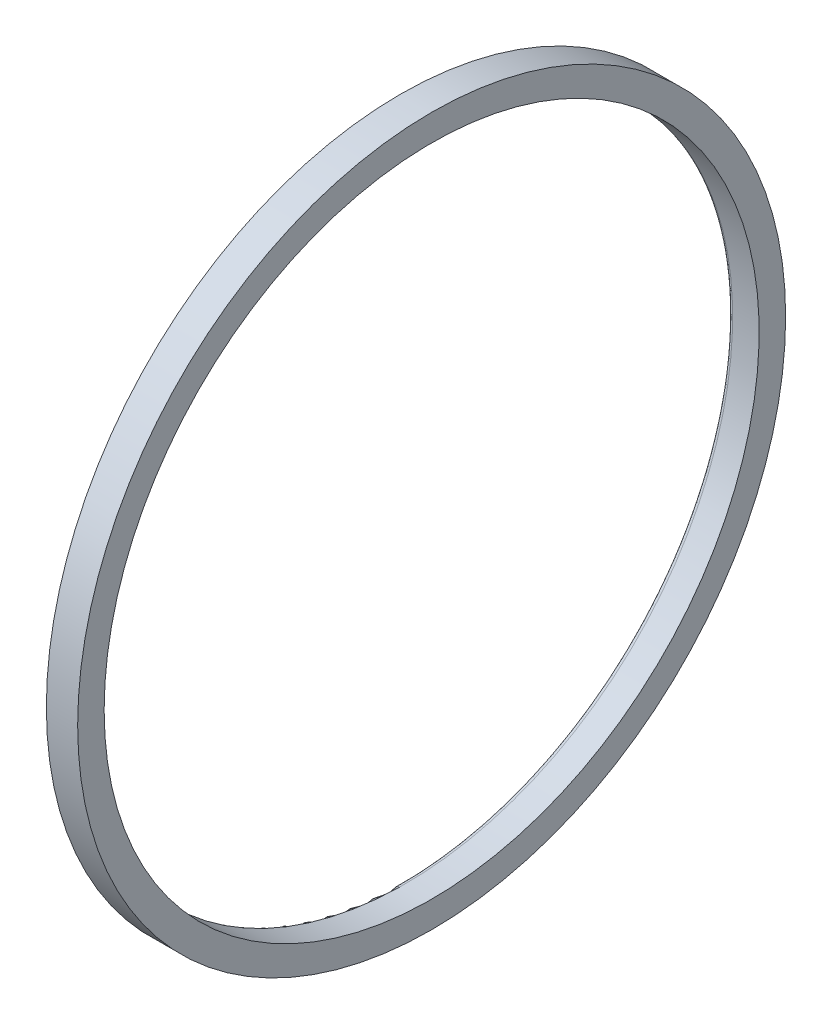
ISO-10303-21;
HEADER;
FILE_DESCRIPTION(('STEP AP214'),'2;1');
FILE_NAME('part.step','',(''),(''),'','','');
FILE_SCHEMA(('AUTOMOTIVE_DESIGN { 1 0 10303 214 1 1 1 1 }'));
ENDSEC;
DATA;
#1=APPLICATION_CONTEXT('core data for automotive mechanical design processes');
#2=APPLICATION_PROTOCOL_DEFINITION('international standard','automotive_design',2000,#1);
#3=PRODUCT_CONTEXT('',#1,'mechanical');
#4=PRODUCT('Part','Part','',(#3));
#5=PRODUCT_RELATED_PRODUCT_CATEGORY('part','',(#4));
#6=PRODUCT_DEFINITION_FORMATION('','',#4);
#7=PRODUCT_DEFINITION_CONTEXT('part definition',#1,'design');
#8=PRODUCT_DEFINITION('design','',#6,#7);
#9=PRODUCT_DEFINITION_SHAPE('','',#8);
#10=(LENGTH_UNIT() NAMED_UNIT(*) SI_UNIT(.MILLI.,.METRE.));
#11=(NAMED_UNIT(*) PLANE_ANGLE_UNIT() SI_UNIT($,.RADIAN.));
#12=(NAMED_UNIT(*) SI_UNIT($,.STERADIAN.) SOLID_ANGLE_UNIT());
#13=UNCERTAINTY_MEASURE_WITH_UNIT(LENGTH_MEASURE(1.E-05),#10,'distance_accuracy_value','');
#14=(GEOMETRIC_REPRESENTATION_CONTEXT(3) GLOBAL_UNCERTAINTY_ASSIGNED_CONTEXT((#13)) GLOBAL_UNIT_ASSIGNED_CONTEXT((#10,
#11,#12)) REPRESENTATION_CONTEXT('',''));
#15=CARTESIAN_POINT('',(0.,0.,0.));
#16=DIRECTION('',(0.,0.,1.));
#17=DIRECTION('',(1.,0.,0.));
#18=AXIS2_PLACEMENT_3D('',#15,#16,#17);
#19=CARTESIAN_POINT('',(3.81,17.272,0.));
#20=DIRECTION('',(-1.,0.,0.));
#21=DIRECTION('',(0.,0.,1.));
#22=AXIS2_PLACEMENT_3D('',#19,#20,#21);
#23=PLANE('',#22);
#24=CARTESIAN_POINT('',(3.81,0.,0.));
#25=DIRECTION('',(-1.,0.,0.));
#26=DIRECTION('',(0.,0.,1.));
#27=AXIS2_PLACEMENT_3D('',#24,#25,#26);
#28=CIRCLE('',#27,18.669);
#29=CARTESIAN_POINT('',(3.81,0.,18.669));
#30=VERTEX_POINT('',#29);
#31=EDGE_CURVE('E10',#30,#30,#28,.T.);
#32=ORIENTED_EDGE('',*,*,#31,.F.);
#33=EDGE_LOOP('',(#32));
#34=FACE_BOUND('',#33,.T.);
#35=CARTESIAN_POINT('',(3.81,0.,0.));
#36=DIRECTION('',(-1.,0.,0.));
#37=DIRECTION('',(0.,0.,1.));
#38=AXIS2_PLACEMENT_3D('',#35,#36,#37);
#39=CIRCLE('',#38,17.272);
#40=CARTESIAN_POINT('',(3.81,0.,17.272));
#41=VERTEX_POINT('',#40);
#42=EDGE_CURVE('E47',#41,#41,#39,.T.);
#43=ORIENTED_EDGE('',*,*,#42,.T.);
#44=EDGE_LOOP('',(#43));
#45=FACE_BOUND('',#44,.T.);
#46=ADVANCED_FACE('F28',(#34,#45),#23,.F.);
#47=CARTESIAN_POINT('',(0.,0.,0.));
#48=DIRECTION('',(-1.,0.,0.));
#49=DIRECTION('',(0.,0.,1.));
#50=AXIS2_PLACEMENT_3D('',#47,#48,#49);
#51=CYLINDRICAL_SURFACE('',#50,18.669);
#52=CARTESIAN_POINT('',(2.159,0.,0.));
#53=DIRECTION('',(-1.,0.,0.));
#54=DIRECTION('',(0.,0.,1.));
#55=AXIS2_PLACEMENT_3D('',#52,#53,#54);
#56=CIRCLE('',#55,18.669);
#57=CARTESIAN_POINT('',(2.159,0.,18.669));
#58=VERTEX_POINT('',#57);
#59=EDGE_CURVE('E34',#58,#58,#56,.T.);
#60=ORIENTED_EDGE('',*,*,#59,.F.);
#61=EDGE_LOOP('',(#60));
#62=FACE_BOUND('',#61,.T.);
#63=ORIENTED_EDGE('',*,*,#31,.T.);
#64=EDGE_LOOP('',(#63));
#65=FACE_BOUND('',#64,.T.);
#66=ADVANCED_FACE('F66',(#62,#65),#51,.T.);
#67=CARTESIAN_POINT('',(2.159,18.669,0.));
#68=DIRECTION('',(1.,0.,0.));
#69=DIRECTION('',(0.,0.,-1.));
#70=AXIS2_PLACEMENT_3D('',#67,#68,#69);
#71=PLANE('',#70);
#72=CARTESIAN_POINT('',(2.159,0.,0.));
#73=DIRECTION('',(-1.,0.,0.));
#74=DIRECTION('',(0.,0.,1.));
#75=AXIS2_PLACEMENT_3D('',#72,#73,#74);
#76=CIRCLE('',#75,17.526);
#77=CARTESIAN_POINT('',(2.159,0.,17.526));
#78=VERTEX_POINT('',#77);
#79=EDGE_CURVE('E38',#78,#78,#76,.T.);
#80=ORIENTED_EDGE('',*,*,#79,.F.);
#81=EDGE_LOOP('',(#80));
#82=FACE_BOUND('',#81,.T.);
#83=ORIENTED_EDGE('',*,*,#59,.T.);
#84=EDGE_LOOP('',(#83));
#85=FACE_BOUND('',#84,.T.);
#86=ADVANCED_FACE('F61',(#82,#85),#71,.F.);
#87=CARTESIAN_POINT('',(2.413,0.,0.));
#88=DIRECTION('',(-1.,0.,0.));
#89=DIRECTION('',(0.,0.,1.));
#90=AXIS2_PLACEMENT_3D('',#87,#88,#89);
#91=TOROIDAL_SURFACE('',#90,17.526,0.254000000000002);
#92=CARTESIAN_POINT('',(2.413,0.,0.));
#93=DIRECTION('',(-1.,0.,0.));
#94=DIRECTION('',(0.,0.,1.));
#95=AXIS2_PLACEMENT_3D('',#92,#93,#94);
#96=CIRCLE('',#95,17.272);
#97=CARTESIAN_POINT('',(2.413,0.,17.272));
#98=VERTEX_POINT('',#97);
#99=EDGE_CURVE('E42',#98,#98,#96,.T.);
#100=ORIENTED_EDGE('',*,*,#99,.F.);
#101=EDGE_LOOP('',(#100));
#102=FACE_BOUND('',#101,.T.);
#103=ORIENTED_EDGE('',*,*,#79,.T.);
#104=EDGE_LOOP('',(#103));
#105=FACE_BOUND('',#104,.T.);
#106=ADVANCED_FACE('F55',(#102,#105),#91,.T.);
#107=CARTESIAN_POINT('',(0.,0.,0.));
#108=DIRECTION('',(-1.,0.,0.));
#109=DIRECTION('',(0.,0.,1.));
#110=AXIS2_PLACEMENT_3D('',#107,#108,#109);
#111=CYLINDRICAL_SURFACE('',#110,17.272);
#112=ORIENTED_EDGE('',*,*,#42,.F.);
#113=EDGE_LOOP('',(#112));
#114=FACE_BOUND('',#113,.T.);
#115=ORIENTED_EDGE('',*,*,#99,.T.);
#116=EDGE_LOOP('',(#115));
#117=FACE_BOUND('',#116,.T.);
#118=ADVANCED_FACE('F52',(#114,#117),#111,.F.);
#119=CLOSED_SHELL('',(#46,#66,#86,#106,#118));
#120=MANIFOLD_SOLID_BREP('B2',#119);
#121=ADVANCED_BREP_SHAPE_REPRESENTATION('',(#18,#120),#14);
#122=SHAPE_DEFINITION_REPRESENTATION(#9,#121);
ENDSEC;
END-ISO-10303-21;
